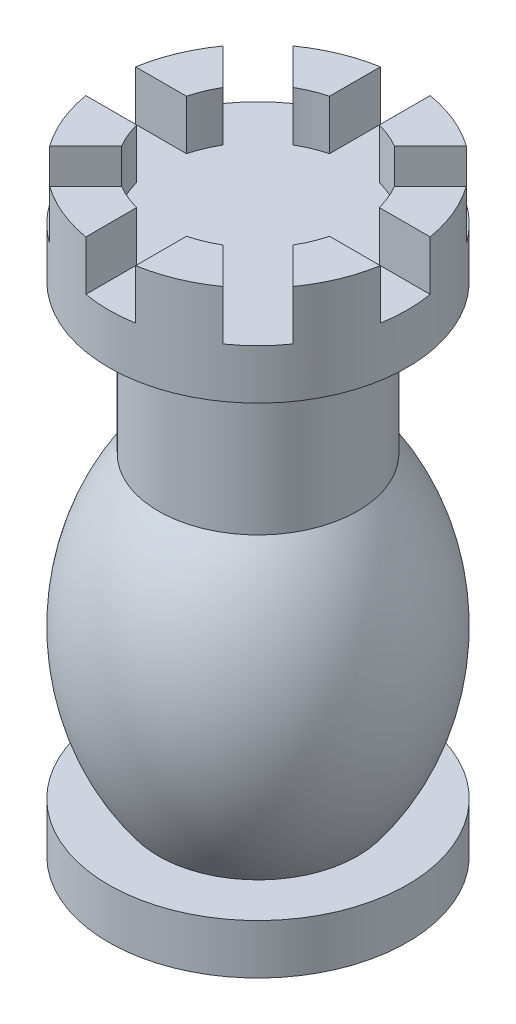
ISO-10303-21;
HEADER;
FILE_DESCRIPTION(('STEP AP214'),'2;1');
FILE_NAME('part.step','',(''),(''),'','','');
FILE_SCHEMA(('AUTOMOTIVE_DESIGN { 1 0 10303 214 1 1 1 1 }'));
ENDSEC;
DATA;
#1=APPLICATION_CONTEXT('core data for automotive mechanical design processes');
#2=APPLICATION_PROTOCOL_DEFINITION('international standard','automotive_design',2000,#1);
#3=PRODUCT_CONTEXT('',#1,'mechanical');
#4=PRODUCT('Part','Part','',(#3));
#5=PRODUCT_RELATED_PRODUCT_CATEGORY('part','',(#4));
#6=PRODUCT_DEFINITION_FORMATION('','',#4);
#7=PRODUCT_DEFINITION_CONTEXT('part definition',#1,'design');
#8=PRODUCT_DEFINITION('design','',#6,#7);
#9=PRODUCT_DEFINITION_SHAPE('','',#8);
#10=(LENGTH_UNIT() NAMED_UNIT(*) SI_UNIT(.MILLI.,.METRE.));
#11=(NAMED_UNIT(*) PLANE_ANGLE_UNIT() SI_UNIT($,.RADIAN.));
#12=(NAMED_UNIT(*) SI_UNIT($,.STERADIAN.) SOLID_ANGLE_UNIT());
#13=UNCERTAINTY_MEASURE_WITH_UNIT(LENGTH_MEASURE(1.E-05),#10,'distance_accuracy_value','');
#14=(GEOMETRIC_REPRESENTATION_CONTEXT(3) GLOBAL_UNCERTAINTY_ASSIGNED_CONTEXT((#13)) GLOBAL_UNIT_ASSIGNED_CONTEXT((#10,
#11,#12)) REPRESENTATION_CONTEXT('',''));
#15=CARTESIAN_POINT('',(0.,0.,0.));
#16=DIRECTION('',(0.,0.,1.));
#17=DIRECTION('',(1.,0.,0.));
#18=AXIS2_PLACEMENT_3D('',#15,#16,#17);
#19=CARTESIAN_POINT('',(0.,34.3216430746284,0.));
#20=DIRECTION('',(0.,1.,0.));
#21=DIRECTION('',(-1.,0.,0.));
#22=AXIS2_PLACEMENT_3D('',#19,#20,#21);
#23=CYLINDRICAL_SURFACE('',#22,4.);
#24=DIRECTION('',(0.,1.,0.));
#25=VECTOR('',#24,1.);
#26=CARTESIAN_POINT('',(-3.44571956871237,34.3216430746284,2.03150600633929));
#27=LINE('',#26,#25);
#28=CARTESIAN_POINT('',(-3.44571956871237,22.,2.03150600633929));
#29=VERTEX_POINT('',#28);
#30=CARTESIAN_POINT('',(-3.44571956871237,24.,2.03150600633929));
#31=VERTEX_POINT('',#30);
#32=EDGE_CURVE('E457',#29,#31,#27,.T.);
#33=ORIENTED_EDGE('',*,*,#32,.F.);
#34=CARTESIAN_POINT('',(0.,22.,0.));
#35=DIRECTION('',(0.,1.,0.));
#36=DIRECTION('',(-1.,0.,0.));
#37=AXIS2_PLACEMENT_3D('',#34,#35,#36);
#38=CIRCLE('',#37,4.);
#39=CARTESIAN_POINT('',(-3.87298334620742,22.,1.));
#40=VERTEX_POINT('',#39);
#41=EDGE_CURVE('E544',#40,#29,#38,.T.);
#42=ORIENTED_EDGE('',*,*,#41,.F.);
#43=DIRECTION('',(0.,1.,0.));
#44=VECTOR('',#43,1.);
#45=CARTESIAN_POINT('',(-3.87298334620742,34.3216430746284,1.));
#46=LINE('',#45,#44);
#47=CARTESIAN_POINT('',(-3.87298334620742,24.,1.));
#48=VERTEX_POINT('',#47);
#49=EDGE_CURVE('E466',#48,#40,#46,.F.);
#50=ORIENTED_EDGE('',*,*,#49,.F.);
#51=CARTESIAN_POINT('',(0.,24.,0.));
#52=DIRECTION('',(0.,1.,0.));
#53=DIRECTION('',(-1.,0.,0.));
#54=AXIS2_PLACEMENT_3D('',#51,#52,#53);
#55=CIRCLE('',#54,4.);
#56=EDGE_CURVE('E286',#48,#31,#55,.T.);
#57=ORIENTED_EDGE('',*,*,#56,.T.);
#58=EDGE_LOOP('',(#33,#42,#50,#57));
#59=FACE_BOUND('',#58,.T.);
#60=ADVANCED_FACE('F33',(#59),#23,.F.);
#61=DIRECTION('',(0.,1.,0.));
#62=VECTOR('',#61,1.);
#63=CARTESIAN_POINT('',(-2.03150600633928,34.3216430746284,3.44571956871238));
#64=LINE('',#63,#62);
#65=CARTESIAN_POINT('',(-2.03150600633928,24.,3.44571956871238));
#66=VERTEX_POINT('',#65);
#67=CARTESIAN_POINT('',(-2.03150600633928,22.,3.44571956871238));
#68=VERTEX_POINT('',#67);
#69=EDGE_CURVE('E455',#66,#68,#64,.F.);
#70=ORIENTED_EDGE('',*,*,#69,.F.);
#71=CARTESIAN_POINT('',(-0.999999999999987,24.,3.87298334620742));
#72=VERTEX_POINT('',#71);
#73=EDGE_CURVE('E547',#66,#72,#55,.T.);
#74=ORIENTED_EDGE('',*,*,#73,.T.);
#75=DIRECTION('',(0.,1.,0.));
#76=VECTOR('',#75,1.);
#77=CARTESIAN_POINT('',(-0.999999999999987,34.3216430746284,3.87298334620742));
#78=LINE('',#77,#76);
#79=CARTESIAN_POINT('',(-0.999999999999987,22.,3.87298334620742));
#80=VERTEX_POINT('',#79);
#81=EDGE_CURVE('E453',#80,#72,#78,.T.);
#82=ORIENTED_EDGE('',*,*,#81,.F.);
#83=EDGE_CURVE('E550',#68,#80,#38,.T.);
#84=ORIENTED_EDGE('',*,*,#83,.F.);
#85=EDGE_LOOP('',(#70,#74,#82,#84));
#86=FACE_BOUND('',#85,.T.);
#87=ADVANCED_FACE('F505',(#86),#23,.F.);
#88=DIRECTION('',(0.,1.,0.));
#89=VECTOR('',#88,1.);
#90=CARTESIAN_POINT('',(1.00000000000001,34.3216430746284,3.87298334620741));
#91=LINE('',#90,#89);
#92=CARTESIAN_POINT('',(1.00000000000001,24.,3.87298334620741));
#93=VERTEX_POINT('',#92);
#94=CARTESIAN_POINT('',(1.00000000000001,22.,3.87298334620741));
#95=VERTEX_POINT('',#94);
#96=EDGE_CURVE('E451',#93,#95,#91,.F.);
#97=ORIENTED_EDGE('',*,*,#96,.F.);
#98=CARTESIAN_POINT('',(2.0315060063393,24.,3.44571956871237));
#99=VERTEX_POINT('',#98);
#100=EDGE_CURVE('E912',#93,#99,#55,.T.);
#101=ORIENTED_EDGE('',*,*,#100,.T.);
#102=DIRECTION('',(0.,1.,0.));
#103=VECTOR('',#102,1.);
#104=CARTESIAN_POINT('',(2.0315060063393,34.3216430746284,3.44571956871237));
#105=LINE('',#104,#103);
#106=CARTESIAN_POINT('',(2.0315060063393,22.,3.44571956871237));
#107=VERTEX_POINT('',#106);
#108=EDGE_CURVE('E449',#107,#99,#105,.T.);
#109=ORIENTED_EDGE('',*,*,#108,.F.);
#110=EDGE_CURVE('E554',#95,#107,#38,.T.);
#111=ORIENTED_EDGE('',*,*,#110,.F.);
#112=EDGE_LOOP('',(#97,#101,#109,#111));
#113=FACE_BOUND('',#112,.T.);
#114=ADVANCED_FACE('F511',(#113),#23,.F.);
#115=DIRECTION('',(0.,1.,0.));
#116=VECTOR('',#115,1.);
#117=CARTESIAN_POINT('',(3.44571956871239,34.3216430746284,2.03150600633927));
#118=LINE('',#117,#116);
#119=CARTESIAN_POINT('',(3.44571956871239,24.,2.03150600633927));
#120=VERTEX_POINT('',#119);
#121=CARTESIAN_POINT('',(3.44571956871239,22.,2.03150600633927));
#122=VERTEX_POINT('',#121);
#123=EDGE_CURVE('E447',#120,#122,#118,.F.);
#124=ORIENTED_EDGE('',*,*,#123,.F.);
#125=CARTESIAN_POINT('',(3.87298334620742,24.,1.));
#126=VERTEX_POINT('',#125);
#127=EDGE_CURVE('E913',#120,#126,#55,.T.);
#128=ORIENTED_EDGE('',*,*,#127,.T.);
#129=DIRECTION('',(0.,1.,0.));
#130=VECTOR('',#129,1.);
#131=CARTESIAN_POINT('',(3.87298334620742,34.3216430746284,1.));
#132=LINE('',#131,#130);
#133=CARTESIAN_POINT('',(3.87298334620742,22.,1.));
#134=VERTEX_POINT('',#133);
#135=EDGE_CURVE('E445',#134,#126,#132,.T.);
#136=ORIENTED_EDGE('',*,*,#135,.F.);
#137=EDGE_CURVE('E557',#122,#134,#38,.T.);
#138=ORIENTED_EDGE('',*,*,#137,.F.);
#139=EDGE_LOOP('',(#124,#128,#136,#138));
#140=FACE_BOUND('',#139,.T.);
#141=ADVANCED_FACE('F775',(#140),#23,.F.);
#142=DIRECTION('',(0.,1.,0.));
#143=VECTOR('',#142,1.);
#144=CARTESIAN_POINT('',(3.87298334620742,34.3216430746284,-1.));
#145=LINE('',#144,#143);
#146=CARTESIAN_POINT('',(3.87298334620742,24.,-1.));
#147=VERTEX_POINT('',#146);
#148=CARTESIAN_POINT('',(3.87298334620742,22.,-1.));
#149=VERTEX_POINT('',#148);
#150=EDGE_CURVE('E443',#147,#149,#145,.F.);
#151=ORIENTED_EDGE('',*,*,#150,.F.);
#152=CARTESIAN_POINT('',(3.44571956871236,24.,-2.03150600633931));
#153=VERTEX_POINT('',#152);
#154=EDGE_CURVE('E896',#147,#153,#55,.T.);
#155=ORIENTED_EDGE('',*,*,#154,.T.);
#156=DIRECTION('',(0.,1.,0.));
#157=VECTOR('',#156,1.);
#158=CARTESIAN_POINT('',(3.44571956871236,34.3216430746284,-2.03150600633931));
#159=LINE('',#158,#157);
#160=CARTESIAN_POINT('',(3.44571956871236,22.,-2.03150600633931));
#161=VERTEX_POINT('',#160);
#162=EDGE_CURVE('E441',#161,#153,#159,.T.);
#163=ORIENTED_EDGE('',*,*,#162,.F.);
#164=EDGE_CURVE('E560',#149,#161,#38,.T.);
#165=ORIENTED_EDGE('',*,*,#164,.F.);
#166=EDGE_LOOP('',(#151,#155,#163,#165));
#167=FACE_BOUND('',#166,.T.);
#168=ADVANCED_FACE('F531',(#167),#23,.F.);
#169=DIRECTION('',(0.,1.,0.));
#170=VECTOR('',#169,1.);
#171=CARTESIAN_POINT('',(2.03150600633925,34.3216430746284,-3.4457195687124));
#172=LINE('',#171,#170);
#173=CARTESIAN_POINT('',(2.03150600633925,24.,-3.4457195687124));
#174=VERTEX_POINT('',#173);
#175=CARTESIAN_POINT('',(2.03150600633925,22.,-3.4457195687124));
#176=VERTEX_POINT('',#175);
#177=EDGE_CURVE('E439',#174,#176,#172,.F.);
#178=ORIENTED_EDGE('',*,*,#177,.F.);
#179=CARTESIAN_POINT('',(0.999999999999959,24.,-3.87298334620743));
#180=VERTEX_POINT('',#179);
#181=EDGE_CURVE('E569',#174,#180,#55,.T.);
#182=ORIENTED_EDGE('',*,*,#181,.T.);
#183=DIRECTION('',(0.,1.,0.));
#184=VECTOR('',#183,1.);
#185=CARTESIAN_POINT('',(0.999999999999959,34.3216430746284,-3.87298334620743));
#186=LINE('',#185,#184);
#187=CARTESIAN_POINT('',(0.999999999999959,22.,-3.87298334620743));
#188=VERTEX_POINT('',#187);
#189=EDGE_CURVE('E437',#188,#180,#186,.T.);
#190=ORIENTED_EDGE('',*,*,#189,.F.);
#191=EDGE_CURVE('E545',#176,#188,#38,.T.);
#192=ORIENTED_EDGE('',*,*,#191,.F.);
#193=EDGE_LOOP('',(#178,#182,#190,#192));
#194=FACE_BOUND('',#193,.T.);
#195=ADVANCED_FACE('F524',(#194),#23,.F.);
#196=DIRECTION('',(0.,1.,0.));
#197=VECTOR('',#196,1.);
#198=CARTESIAN_POINT('',(-1.00000000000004,34.3216430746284,-3.87298334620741));
#199=LINE('',#198,#197);
#200=CARTESIAN_POINT('',(-1.00000000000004,24.,-3.87298334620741));
#201=VERTEX_POINT('',#200);
#202=CARTESIAN_POINT('',(-1.00000000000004,22.,-3.87298334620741));
#203=VERTEX_POINT('',#202);
#204=EDGE_CURVE('E435',#201,#203,#199,.F.);
#205=ORIENTED_EDGE('',*,*,#204,.F.);
#206=CARTESIAN_POINT('',(-2.03150600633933,24.,-3.44571956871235));
#207=VERTEX_POINT('',#206);
#208=EDGE_CURVE('E285',#201,#207,#55,.T.);
#209=ORIENTED_EDGE('',*,*,#208,.T.);
#210=DIRECTION('',(0.,1.,0.));
#211=VECTOR('',#210,1.);
#212=CARTESIAN_POINT('',(-2.03150600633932,34.3216430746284,-3.44571956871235));
#213=LINE('',#212,#211);
#214=CARTESIAN_POINT('',(-2.03150600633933,22.,-3.44571956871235));
#215=VERTEX_POINT('',#214);
#216=EDGE_CURVE('E433',#215,#207,#213,.T.);
#217=ORIENTED_EDGE('',*,*,#216,.F.);
#218=EDGE_CURVE('E536',#203,#215,#38,.T.);
#219=ORIENTED_EDGE('',*,*,#218,.F.);
#220=EDGE_LOOP('',(#205,#209,#217,#219));
#221=FACE_BOUND('',#220,.T.);
#222=ADVANCED_FACE('F517',(#221),#23,.F.);
#223=CARTESIAN_POINT('',(-4.,24.,0.));
#224=DIRECTION('',(0.,1.,0.));
#225=DIRECTION('',(-1.,0.,0.));
#226=AXIS2_PLACEMENT_3D('',#223,#224,#225);
#227=PLANE('',#226);
#228=DIRECTION('',(-0.707106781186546,0.,0.707106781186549));
#229=VECTOR('',#228,1.);
#230=CARTESIAN_POINT('',(-5.6737446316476,24.,4.25953106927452));
#231=LINE('',#230,#229);
#232=CARTESIAN_POINT('',(-4.89040691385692,24.,3.47619335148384));
#233=VERTEX_POINT('',#232);
#234=EDGE_CURVE('E427',#31,#233,#231,.T.);
#235=ORIENTED_EDGE('',*,*,#234,.F.);
#236=ORIENTED_EDGE('',*,*,#56,.F.);
#237=DIRECTION('',(1.,0.,0.));
#238=VECTOR('',#237,1.);
#239=CARTESIAN_POINT('',(-7.02388660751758,24.,1.));
#240=LINE('',#239,#238);
#241=CARTESIAN_POINT('',(-5.91607978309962,24.,1.));
#242=VERTEX_POINT('',#241);
#243=EDGE_CURVE('E459',#242,#48,#240,.T.);
#244=ORIENTED_EDGE('',*,*,#243,.F.);
#245=CARTESIAN_POINT('',(0.,24.,0.));
#246=DIRECTION('',(0.,1.,0.));
#247=DIRECTION('',(-1.,0.,0.));
#248=AXIS2_PLACEMENT_3D('',#245,#246,#247);
#249=CIRCLE('',#248,6.);
#250=EDGE_CURVE('E272',#242,#233,#249,.T.);
#251=ORIENTED_EDGE('',*,*,#250,.T.);
#252=EDGE_LOOP('',(#235,#236,#244,#251));
#253=FACE_BOUND('',#252,.T.);
#254=ADVANCED_FACE('F522',(#253),#227,.T.);
#255=DIRECTION('',(0.707106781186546,0.,-0.707106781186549));
#256=VECTOR('',#255,1.);
#257=CARTESIAN_POINT('',(-4.2595310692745,24.,5.67374463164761));
#258=LINE('',#257,#256);
#259=CARTESIAN_POINT('',(-3.47619335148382,24.,4.89040691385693));
#260=VERTEX_POINT('',#259);
#261=EDGE_CURVE('E421',#260,#66,#258,.T.);
#262=ORIENTED_EDGE('',*,*,#261,.F.);
#263=CARTESIAN_POINT('',(-0.999999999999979,24.,5.91607978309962));
#264=VERTEX_POINT('',#263);
#265=EDGE_CURVE('E280',#260,#264,#249,.T.);
#266=ORIENTED_EDGE('',*,*,#265,.T.);
#267=DIRECTION('',(0.,0.,1.));
#268=VECTOR('',#267,1.);
#269=CARTESIAN_POINT('',(-0.999999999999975,24.,7.02388660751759));
#270=LINE('',#269,#268);
#271=EDGE_CURVE('E418',#72,#264,#270,.T.);
#272=ORIENTED_EDGE('',*,*,#271,.F.);
#273=ORIENTED_EDGE('',*,*,#73,.F.);
#274=EDGE_LOOP('',(#262,#266,#272,#273));
#275=FACE_BOUND('',#274,.T.);
#276=ADVANCED_FACE('F530',(#275),#227,.T.);
#277=DIRECTION('',(0.,0.,-1.));
#278=VECTOR('',#277,1.);
#279=CARTESIAN_POINT('',(1.00000000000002,24.,7.02388660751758));
#280=LINE('',#279,#278);
#281=CARTESIAN_POINT('',(1.00000000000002,24.,5.91607978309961));
#282=VERTEX_POINT('',#281);
#283=EDGE_CURVE('E413',#282,#93,#280,.T.);
#284=ORIENTED_EDGE('',*,*,#283,.F.);
#285=CARTESIAN_POINT('',(3.47619335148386,24.,4.89040691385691));
#286=VERTEX_POINT('',#285);
#287=EDGE_CURVE('E288',#282,#286,#249,.T.);
#288=ORIENTED_EDGE('',*,*,#287,.T.);
#289=DIRECTION('',(0.707106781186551,0.,0.707106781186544));
#290=VECTOR('',#289,1.);
#291=CARTESIAN_POINT('',(4.25953106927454,24.,5.67374463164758));
#292=LINE('',#291,#290);
#293=EDGE_CURVE('E410',#99,#286,#292,.T.);
#294=ORIENTED_EDGE('',*,*,#293,.F.);
#295=ORIENTED_EDGE('',*,*,#100,.F.);
#296=EDGE_LOOP('',(#284,#288,#294,#295));
#297=FACE_BOUND('',#296,.T.);
#298=ADVANCED_FACE('F811',(#297),#227,.T.);
#299=DIRECTION('',(-0.707106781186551,0.,-0.707106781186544));
#300=VECTOR('',#299,1.);
#301=CARTESIAN_POINT('',(5.67374463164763,24.,4.25953106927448));
#302=LINE('',#301,#300);
#303=CARTESIAN_POINT('',(4.89040691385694,24.,3.4761933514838));
#304=VERTEX_POINT('',#303);
#305=EDGE_CURVE('E403',#304,#120,#302,.T.);
#306=ORIENTED_EDGE('',*,*,#305,.F.);
#307=CARTESIAN_POINT('',(5.91607978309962,24.,1.));
#308=VERTEX_POINT('',#307);
#309=EDGE_CURVE('E294',#304,#308,#249,.T.);
#310=ORIENTED_EDGE('',*,*,#309,.T.);
#311=DIRECTION('',(1.,0.,0.));
#312=VECTOR('',#311,1.);
#313=CARTESIAN_POINT('',(7.02388660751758,24.,1.));
#314=LINE('',#313,#312);
#315=EDGE_CURVE('E400',#126,#308,#314,.T.);
#316=ORIENTED_EDGE('',*,*,#315,.F.);
#317=ORIENTED_EDGE('',*,*,#127,.F.);
#318=EDGE_LOOP('',(#306,#310,#316,#317));
#319=FACE_BOUND('',#318,.T.);
#320=ADVANCED_FACE('F818',(#319),#227,.T.);
#321=DIRECTION('',(-1.,0.,0.));
#322=VECTOR('',#321,1.);
#323=CARTESIAN_POINT('',(7.02388660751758,24.,-1.));
#324=LINE('',#323,#322);
#325=CARTESIAN_POINT('',(5.91607978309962,24.,-1.));
#326=VERTEX_POINT('',#325);
#327=EDGE_CURVE('E393',#326,#147,#324,.T.);
#328=ORIENTED_EDGE('',*,*,#327,.F.);
#329=CARTESIAN_POINT('',(4.8904069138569,24.,-3.47619335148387));
#330=VERTEX_POINT('',#329);
#331=EDGE_CURVE('E300',#326,#330,#249,.T.);
#332=ORIENTED_EDGE('',*,*,#331,.T.);
#333=DIRECTION('',(0.707106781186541,0.,-0.707106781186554));
#334=VECTOR('',#333,1.);
#335=CARTESIAN_POINT('',(5.67374463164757,24.,-4.25953106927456));
#336=LINE('',#335,#334);
#337=EDGE_CURVE('E390',#153,#330,#336,.T.);
#338=ORIENTED_EDGE('',*,*,#337,.F.);
#339=ORIENTED_EDGE('',*,*,#154,.F.);
#340=EDGE_LOOP('',(#328,#332,#338,#339));
#341=FACE_BOUND('',#340,.T.);
#342=ADVANCED_FACE('F825',(#341),#227,.T.);
#343=DIRECTION('',(-0.707106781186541,0.,0.707106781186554));
#344=VECTOR('',#343,1.);
#345=CARTESIAN_POINT('',(4.25953106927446,24.,-5.67374463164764));
#346=LINE('',#345,#344);
#347=CARTESIAN_POINT('',(3.47619335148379,24.,-4.89040691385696));
#348=VERTEX_POINT('',#347);
#349=EDGE_CURVE('E319',#348,#174,#346,.T.);
#350=ORIENTED_EDGE('',*,*,#349,.F.);
#351=CARTESIAN_POINT('',(0.999999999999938,24.,-5.91607978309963));
#352=VERTEX_POINT('',#351);
#353=EDGE_CURVE('E274',#348,#352,#249,.T.);
#354=ORIENTED_EDGE('',*,*,#353,.T.);
#355=DIRECTION('',(0.,0.,-1.));
#356=VECTOR('',#355,1.);
#357=CARTESIAN_POINT('',(0.999999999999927,24.,-7.02388660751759));
#358=LINE('',#357,#356);
#359=EDGE_CURVE('E317',#180,#352,#358,.T.);
#360=ORIENTED_EDGE('',*,*,#359,.F.);
#361=ORIENTED_EDGE('',*,*,#181,.F.);
#362=EDGE_LOOP('',(#350,#354,#360,#361));
#363=FACE_BOUND('',#362,.T.);
#364=ADVANCED_FACE('F315',(#363),#227,.T.);
#365=DIRECTION('',(0.,0.,1.));
#366=VECTOR('',#365,1.);
#367=CARTESIAN_POINT('',(-1.00000000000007,24.,-7.02388660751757));
#368=LINE('',#367,#366);
#369=CARTESIAN_POINT('',(-1.00000000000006,24.,-5.91607978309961));
#370=VERTEX_POINT('',#369);
#371=EDGE_CURVE('E368',#370,#201,#368,.T.);
#372=ORIENTED_EDGE('',*,*,#371,.F.);
#373=CARTESIAN_POINT('',(-3.47619335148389,24.,-4.89040691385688));
#374=VERTEX_POINT('',#373);
#375=EDGE_CURVE('E269',#370,#374,#249,.T.);
#376=ORIENTED_EDGE('',*,*,#375,.T.);
#377=DIRECTION('',(-0.707106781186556,0.,-0.707106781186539));
#378=VECTOR('',#377,1.);
#379=CARTESIAN_POINT('',(-4.25953106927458,24.,-5.67374463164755));
#380=LINE('',#379,#378);
#381=EDGE_CURVE('E261',#207,#374,#380,.T.);
#382=ORIENTED_EDGE('',*,*,#381,.F.);
#383=ORIENTED_EDGE('',*,*,#208,.F.);
#384=EDGE_LOOP('',(#372,#376,#382,#383));
#385=FACE_BOUND('',#384,.T.);
#386=ADVANCED_FACE('F375',(#385),#227,.T.);
#387=CARTESIAN_POINT('',(0.,22.,0.));
#388=DIRECTION('',(0.,1.,0.));
#389=DIRECTION('',(-1.,0.,0.));
#390=AXIS2_PLACEMENT_3D('',#387,#388,#389);
#391=PLANE('',#390);
#392=ORIENTED_EDGE('',*,*,#41,.T.);
#393=DIRECTION('',(-0.707106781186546,0.,0.707106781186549));
#394=VECTOR('',#393,1.);
#395=CARTESIAN_POINT('',(-5.6737446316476,22.,4.25953106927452));
#396=LINE('',#395,#394);
#397=CARTESIAN_POINT('',(-4.89040691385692,22.,3.47619335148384));
#398=VERTEX_POINT('',#397);
#399=EDGE_CURVE('E48',#29,#398,#396,.T.);
#400=ORIENTED_EDGE('',*,*,#399,.T.);
#401=CARTESIAN_POINT('',(0.,22.,0.));
#402=DIRECTION('',(0.,1.,0.));
#403=DIRECTION('',(0.,0.,1.));
#404=AXIS2_PLACEMENT_3D('',#401,#402,#403);
#405=CIRCLE('',#404,6.);
#406=CARTESIAN_POINT('',(-3.47619335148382,22.,4.89040691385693));
#407=VERTEX_POINT('',#406);
#408=EDGE_CURVE('E355',#407,#398,#405,.F.);
#409=ORIENTED_EDGE('',*,*,#408,.F.);
#410=DIRECTION('',(0.707106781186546,0.,-0.707106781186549));
#411=VECTOR('',#410,1.);
#412=CARTESIAN_POINT('',(-4.2595310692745,22.,5.67374463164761));
#413=LINE('',#412,#411);
#414=EDGE_CURVE('E424',#407,#68,#413,.T.);
#415=ORIENTED_EDGE('',*,*,#414,.T.);
#416=ORIENTED_EDGE('',*,*,#83,.T.);
#417=DIRECTION('',(0.,0.,1.));
#418=VECTOR('',#417,1.);
#419=CARTESIAN_POINT('',(-0.999999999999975,22.,7.02388660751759));
#420=LINE('',#419,#418);
#421=CARTESIAN_POINT('',(-0.999999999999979,22.,5.91607978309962));
#422=VERTEX_POINT('',#421);
#423=EDGE_CURVE('E417',#80,#422,#420,.T.);
#424=ORIENTED_EDGE('',*,*,#423,.T.);
#425=CARTESIAN_POINT('',(1.00000000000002,22.,5.91607978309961));
#426=VERTEX_POINT('',#425);
#427=EDGE_CURVE('E353',#426,#422,#405,.F.);
#428=ORIENTED_EDGE('',*,*,#427,.F.);
#429=DIRECTION('',(0.,0.,-1.));
#430=VECTOR('',#429,1.);
#431=CARTESIAN_POINT('',(1.00000000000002,22.,7.02388660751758));
#432=LINE('',#431,#430);
#433=EDGE_CURVE('E55',#426,#95,#432,.T.);
#434=ORIENTED_EDGE('',*,*,#433,.T.);
#435=ORIENTED_EDGE('',*,*,#110,.T.);
#436=DIRECTION('',(0.707106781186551,0.,0.707106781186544));
#437=VECTOR('',#436,1.);
#438=CARTESIAN_POINT('',(4.25953106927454,22.,5.67374463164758));
#439=LINE('',#438,#437);
#440=CARTESIAN_POINT('',(3.47619335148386,22.,4.89040691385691));
#441=VERTEX_POINT('',#440);
#442=EDGE_CURVE('E409',#107,#441,#439,.T.);
#443=ORIENTED_EDGE('',*,*,#442,.T.);
#444=CARTESIAN_POINT('',(4.89040691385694,22.,3.47619335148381));
#445=VERTEX_POINT('',#444);
#446=EDGE_CURVE('E348',#445,#441,#405,.F.);
#447=ORIENTED_EDGE('',*,*,#446,.F.);
#448=DIRECTION('',(-0.707106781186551,0.,-0.707106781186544));
#449=VECTOR('',#448,1.);
#450=CARTESIAN_POINT('',(5.67374463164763,22.,4.25953106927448));
#451=LINE('',#450,#449);
#452=EDGE_CURVE('E406',#445,#122,#451,.T.);
#453=ORIENTED_EDGE('',*,*,#452,.T.);
#454=ORIENTED_EDGE('',*,*,#137,.T.);
#455=DIRECTION('',(1.,0.,0.));
#456=VECTOR('',#455,1.);
#457=CARTESIAN_POINT('',(7.02388660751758,22.,1.));
#458=LINE('',#457,#456);
#459=CARTESIAN_POINT('',(5.91607978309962,22.,1.));
#460=VERTEX_POINT('',#459);
#461=EDGE_CURVE('E399',#134,#460,#458,.T.);
#462=ORIENTED_EDGE('',*,*,#461,.T.);
#463=CARTESIAN_POINT('',(5.91607978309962,22.,-1.));
#464=VERTEX_POINT('',#463);
#465=EDGE_CURVE('E343',#464,#460,#405,.F.);
#466=ORIENTED_EDGE('',*,*,#465,.F.);
#467=DIRECTION('',(-1.,0.,0.));
#468=VECTOR('',#467,1.);
#469=CARTESIAN_POINT('',(7.02388660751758,22.,-1.));
#470=LINE('',#469,#468);
#471=EDGE_CURVE('E396',#464,#149,#470,.T.);
#472=ORIENTED_EDGE('',*,*,#471,.T.);
#473=ORIENTED_EDGE('',*,*,#164,.T.);
#474=DIRECTION('',(0.707106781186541,0.,-0.707106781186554));
#475=VECTOR('',#474,1.);
#476=CARTESIAN_POINT('',(5.67374463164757,22.,-4.25953106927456));
#477=LINE('',#476,#475);
#478=CARTESIAN_POINT('',(4.8904069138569,22.,-3.47619335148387));
#479=VERTEX_POINT('',#478);
#480=EDGE_CURVE('E389',#161,#479,#477,.T.);
#481=ORIENTED_EDGE('',*,*,#480,.T.);
#482=CARTESIAN_POINT('',(3.47619335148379,22.,-4.89040691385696));
#483=VERTEX_POINT('',#482);
#484=EDGE_CURVE('E332',#483,#479,#405,.F.);
#485=ORIENTED_EDGE('',*,*,#484,.F.);
#486=DIRECTION('',(-0.707106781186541,0.,0.707106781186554));
#487=VECTOR('',#486,1.);
#488=CARTESIAN_POINT('',(4.25953106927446,22.,-5.67374463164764));
#489=LINE('',#488,#487);
#490=EDGE_CURVE('E386',#483,#176,#489,.T.);
#491=ORIENTED_EDGE('',*,*,#490,.T.);
#492=ORIENTED_EDGE('',*,*,#191,.T.);
#493=DIRECTION('',(0.,0.,-1.));
#494=VECTOR('',#493,1.);
#495=CARTESIAN_POINT('',(0.999999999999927,22.,-7.02388660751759));
#496=LINE('',#495,#494);
#497=CARTESIAN_POINT('',(0.999999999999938,22.,-5.91607978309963));
#498=VERTEX_POINT('',#497);
#499=EDGE_CURVE('E383',#188,#498,#496,.T.);
#500=ORIENTED_EDGE('',*,*,#499,.T.);
#501=CARTESIAN_POINT('',(-1.00000000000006,22.,-5.91607978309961));
#502=VERTEX_POINT('',#501);
#503=EDGE_CURVE('E328',#502,#498,#405,.F.);
#504=ORIENTED_EDGE('',*,*,#503,.F.);
#505=DIRECTION('',(0.,0.,1.));
#506=VECTOR('',#505,1.);
#507=CARTESIAN_POINT('',(-1.00000000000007,22.,-7.02388660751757));
#508=LINE('',#507,#506);
#509=EDGE_CURVE('E371',#502,#203,#508,.T.);
#510=ORIENTED_EDGE('',*,*,#509,.T.);
#511=ORIENTED_EDGE('',*,*,#218,.T.);
#512=DIRECTION('',(-0.707106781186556,0.,-0.707106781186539));
#513=VECTOR('',#512,1.);
#514=CARTESIAN_POINT('',(-4.25953106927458,22.,-5.67374463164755));
#515=LINE('',#514,#513);
#516=CARTESIAN_POINT('',(-3.47619335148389,22.,-4.89040691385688));
#517=VERTEX_POINT('',#516);
#518=EDGE_CURVE('E378',#215,#517,#515,.T.);
#519=ORIENTED_EDGE('',*,*,#518,.T.);
#520=CARTESIAN_POINT('',(-4.89040691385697,22.,-3.47619335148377));
#521=VERTEX_POINT('',#520);
#522=EDGE_CURVE('E251',#521,#517,#405,.F.);
#523=ORIENTED_EDGE('',*,*,#522,.F.);
#524=DIRECTION('',(0.707106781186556,0.,0.707106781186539));
#525=VECTOR('',#524,1.);
#526=CARTESIAN_POINT('',(-5.67374463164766,22.,-4.25953106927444));
#527=LINE('',#526,#525);
#528=CARTESIAN_POINT('',(-3.4457195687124,22.,-2.03150600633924));
#529=VERTEX_POINT('',#528);
#530=EDGE_CURVE('E246',#521,#529,#527,.T.);
#531=ORIENTED_EDGE('',*,*,#530,.T.);
#532=CARTESIAN_POINT('',(-3.87298334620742,22.,-1.));
#533=VERTEX_POINT('',#532);
#534=EDGE_CURVE('E540',#529,#533,#38,.T.);
#535=ORIENTED_EDGE('',*,*,#534,.T.);
#536=DIRECTION('',(-1.,0.,0.));
#537=VECTOR('',#536,1.);
#538=CARTESIAN_POINT('',(-7.02388660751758,22.,-1.));
#539=LINE('',#538,#537);
#540=CARTESIAN_POINT('',(-5.91607978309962,22.,-1.));
#541=VERTEX_POINT('',#540);
#542=EDGE_CURVE('E463',#533,#541,#539,.T.);
#543=ORIENTED_EDGE('',*,*,#542,.T.);
#544=CARTESIAN_POINT('',(0.,22.,0.));
#545=DIRECTION('',(0.,1.,0.));
#546=DIRECTION('',(0.,0.,1.));
#547=AXIS2_PLACEMENT_3D('',#544,#545,#546);
#548=CIRCLE('',#547,6.);
#549=CARTESIAN_POINT('',(-5.91607978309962,22.,1.));
#550=VERTEX_POINT('',#549);
#551=EDGE_CURVE('E549',#550,#541,#548,.F.);
#552=ORIENTED_EDGE('',*,*,#551,.F.);
#553=DIRECTION('',(1.,0.,0.));
#554=VECTOR('',#553,1.);
#555=CARTESIAN_POINT('',(-7.02388660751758,22.,1.));
#556=LINE('',#555,#554);
#557=EDGE_CURVE('E460',#550,#40,#556,.T.);
#558=ORIENTED_EDGE('',*,*,#557,.T.);
#559=EDGE_LOOP('',(#392,#400,#409,#415,#416,#424,#428,#434,#435,#443,#447,#453,#454,#462,#466,
#472,#473,#481,#485,#491,#492,#500,#504,#510,#511,#519,#523,#531,#535,#543,#552,#558));
#560=FACE_BOUND('',#559,.T.);
#561=ADVANCED_FACE('F35',(#560),#391,.T.);
#562=DIRECTION('',(0.,1.,0.));
#563=VECTOR('',#562,1.);
#564=CARTESIAN_POINT('',(-3.4457195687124,34.3216430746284,-2.03150600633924));
#565=LINE('',#564,#563);
#566=CARTESIAN_POINT('',(-3.4457195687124,24.,-2.03150600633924));
#567=VERTEX_POINT('',#566);
#568=EDGE_CURVE('E429',#567,#529,#565,.F.);
#569=ORIENTED_EDGE('',*,*,#568,.F.);
#570=CARTESIAN_POINT('',(-3.87298334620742,24.,-1.));
#571=VERTEX_POINT('',#570);
#572=EDGE_CURVE('E260',#567,#571,#55,.T.);
#573=ORIENTED_EDGE('',*,*,#572,.T.);
#574=DIRECTION('',(0.,1.,0.));
#575=VECTOR('',#574,1.);
#576=CARTESIAN_POINT('',(-3.87298334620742,34.3216430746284,-1.));
#577=LINE('',#576,#575);
#578=EDGE_CURVE('E470',#533,#571,#577,.T.);
#579=ORIENTED_EDGE('',*,*,#578,.F.);
#580=ORIENTED_EDGE('',*,*,#534,.F.);
#581=EDGE_LOOP('',(#569,#573,#579,#580));
#582=FACE_BOUND('',#581,.T.);
#583=ADVANCED_FACE('F507',(#582),#23,.F.);
#584=DIRECTION('',(0.707106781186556,0.,0.707106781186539));
#585=VECTOR('',#584,1.);
#586=CARTESIAN_POINT('',(-5.67374463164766,24.,-4.25953106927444));
#587=LINE('',#586,#585);
#588=CARTESIAN_POINT('',(-4.89040691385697,24.,-3.47619335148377));
#589=VERTEX_POINT('',#588);
#590=EDGE_CURVE('E243',#589,#567,#587,.T.);
#591=ORIENTED_EDGE('',*,*,#590,.F.);
#592=CARTESIAN_POINT('',(-5.91607978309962,24.,-1.));
#593=VERTEX_POINT('',#592);
#594=EDGE_CURVE('E258',#589,#593,#249,.T.);
#595=ORIENTED_EDGE('',*,*,#594,.T.);
#596=DIRECTION('',(-1.,0.,0.));
#597=VECTOR('',#596,1.);
#598=CARTESIAN_POINT('',(-7.02388660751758,24.,-1.));
#599=LINE('',#598,#597);
#600=EDGE_CURVE('E464',#571,#593,#599,.T.);
#601=ORIENTED_EDGE('',*,*,#600,.F.);
#602=ORIENTED_EDGE('',*,*,#572,.F.);
#603=EDGE_LOOP('',(#591,#595,#601,#602));
#604=FACE_BOUND('',#603,.T.);
#605=ADVANCED_FACE('F256',(#604),#227,.T.);
#606=CARTESIAN_POINT('',(0.,34.3216430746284,0.));
#607=DIRECTION('',(0.,1.,0.));
#608=DIRECTION('',(-1.,0.,0.));
#609=AXIS2_PLACEMENT_3D('',#606,#607,#608);
#610=CYLINDRICAL_SURFACE('',#609,6.);
#611=DIRECTION('',(0.,1.,0.));
#612=VECTOR('',#611,1.);
#613=CARTESIAN_POINT('',(-4.89040691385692,34.3216430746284,3.47619335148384));
#614=LINE('',#613,#612);
#615=EDGE_CURVE('E11',#233,#398,#614,.F.);
#616=ORIENTED_EDGE('',*,*,#615,.F.);
#617=ORIENTED_EDGE('',*,*,#250,.F.);
#618=DIRECTION('',(0.,1.,0.));
#619=VECTOR('',#618,1.);
#620=CARTESIAN_POINT('',(-5.91607978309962,34.3216430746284,1.));
#621=LINE('',#620,#619);
#622=EDGE_CURVE('E552',#550,#242,#621,.T.);
#623=ORIENTED_EDGE('',*,*,#622,.F.);
#624=ORIENTED_EDGE('',*,*,#551,.T.);
#625=DIRECTION('',(0.,1.,0.));
#626=VECTOR('',#625,1.);
#627=CARTESIAN_POINT('',(-5.91607978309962,34.3216430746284,-1.));
#628=LINE('',#627,#626);
#629=EDGE_CURVE('E252',#593,#541,#628,.F.);
#630=ORIENTED_EDGE('',*,*,#629,.F.);
#631=ORIENTED_EDGE('',*,*,#594,.F.);
#632=DIRECTION('',(0.,1.,0.));
#633=VECTOR('',#632,1.);
#634=CARTESIAN_POINT('',(-4.89040691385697,34.3216430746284,-3.47619335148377));
#635=LINE('',#634,#633);
#636=EDGE_CURVE('E240',#521,#589,#635,.T.);
#637=ORIENTED_EDGE('',*,*,#636,.F.);
#638=ORIENTED_EDGE('',*,*,#522,.T.);
#639=DIRECTION('',(0.,1.,0.));
#640=VECTOR('',#639,1.);
#641=CARTESIAN_POINT('',(-3.47619335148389,34.3216430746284,-4.89040691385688));
#642=LINE('',#641,#640);
#643=EDGE_CURVE('E361',#374,#517,#642,.F.);
#644=ORIENTED_EDGE('',*,*,#643,.F.);
#645=ORIENTED_EDGE('',*,*,#375,.F.);
#646=DIRECTION('',(0.,1.,0.));
#647=VECTOR('',#646,1.);
#648=CARTESIAN_POINT('',(-1.00000000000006,34.3216430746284,-5.91607978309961));
#649=LINE('',#648,#647);
#650=EDGE_CURVE('E334',#502,#370,#649,.T.);
#651=ORIENTED_EDGE('',*,*,#650,.F.);
#652=ORIENTED_EDGE('',*,*,#503,.T.);
#653=DIRECTION('',(0.,1.,0.));
#654=VECTOR('',#653,1.);
#655=CARTESIAN_POINT('',(0.999999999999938,34.3216430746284,-5.91607978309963));
#656=LINE('',#655,#654);
#657=EDGE_CURVE('E325',#352,#498,#656,.F.);
#658=ORIENTED_EDGE('',*,*,#657,.F.);
#659=ORIENTED_EDGE('',*,*,#353,.F.);
#660=DIRECTION('',(0.,1.,0.));
#661=VECTOR('',#660,1.);
#662=CARTESIAN_POINT('',(3.47619335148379,34.3216430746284,-4.89040691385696));
#663=LINE('',#662,#661);
#664=EDGE_CURVE('E323',#483,#348,#663,.T.);
#665=ORIENTED_EDGE('',*,*,#664,.F.);
#666=ORIENTED_EDGE('',*,*,#484,.T.);
#667=DIRECTION('',(0.,1.,0.));
#668=VECTOR('',#667,1.);
#669=CARTESIAN_POINT('',(4.8904069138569,34.3216430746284,-3.47619335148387));
#670=LINE('',#669,#668);
#671=EDGE_CURVE('E339',#330,#479,#670,.F.);
#672=ORIENTED_EDGE('',*,*,#671,.F.);
#673=ORIENTED_EDGE('',*,*,#331,.F.);
#674=DIRECTION('',(0.,1.,0.));
#675=VECTOR('',#674,1.);
#676=CARTESIAN_POINT('',(5.91607978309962,34.3216430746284,-1.));
#677=LINE('',#676,#675);
#678=EDGE_CURVE('E341',#464,#326,#677,.T.);
#679=ORIENTED_EDGE('',*,*,#678,.F.);
#680=ORIENTED_EDGE('',*,*,#465,.T.);
#681=DIRECTION('',(0.,1.,0.));
#682=VECTOR('',#681,1.);
#683=CARTESIAN_POINT('',(5.91607978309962,34.3216430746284,1.));
#684=LINE('',#683,#682);
#685=EDGE_CURVE('E344',#308,#460,#684,.F.);
#686=ORIENTED_EDGE('',*,*,#685,.F.);
#687=ORIENTED_EDGE('',*,*,#309,.F.);
#688=DIRECTION('',(0.,1.,0.));
#689=VECTOR('',#688,1.);
#690=CARTESIAN_POINT('',(4.89040691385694,34.3216430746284,3.47619335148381));
#691=LINE('',#690,#689);
#692=EDGE_CURVE('E346',#445,#304,#691,.T.);
#693=ORIENTED_EDGE('',*,*,#692,.F.);
#694=ORIENTED_EDGE('',*,*,#446,.T.);
#695=DIRECTION('',(0.,1.,0.));
#696=VECTOR('',#695,1.);
#697=CARTESIAN_POINT('',(3.47619335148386,34.3216430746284,4.89040691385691));
#698=LINE('',#697,#696);
#699=EDGE_CURVE('E349',#286,#441,#698,.F.);
#700=ORIENTED_EDGE('',*,*,#699,.F.);
#701=ORIENTED_EDGE('',*,*,#287,.F.);
#702=DIRECTION('',(0.,1.,0.));
#703=VECTOR('',#702,1.);
#704=CARTESIAN_POINT('',(1.00000000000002,34.3216430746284,5.91607978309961));
#705=LINE('',#704,#703);
#706=EDGE_CURVE('E351',#426,#282,#705,.T.);
#707=ORIENTED_EDGE('',*,*,#706,.F.);
#708=ORIENTED_EDGE('',*,*,#427,.T.);
#709=DIRECTION('',(0.,1.,0.));
#710=VECTOR('',#709,1.);
#711=CARTESIAN_POINT('',(-0.999999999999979,34.3216430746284,5.91607978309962));
#712=LINE('',#711,#710);
#713=EDGE_CURVE('E354',#264,#422,#712,.F.);
#714=ORIENTED_EDGE('',*,*,#713,.F.);
#715=ORIENTED_EDGE('',*,*,#265,.F.);
#716=DIRECTION('',(0.,1.,0.));
#717=VECTOR('',#716,1.);
#718=CARTESIAN_POINT('',(-3.47619335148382,34.3216430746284,4.89040691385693));
#719=LINE('',#718,#717);
#720=EDGE_CURVE('E41',#407,#260,#719,.T.);
#721=ORIENTED_EDGE('',*,*,#720,.F.);
#722=ORIENTED_EDGE('',*,*,#408,.T.);
#723=EDGE_LOOP('',(#616,#617,#623,#624,#630,#631,#637,#638,#644,#645,#651,#652,#658,#659,#665,
#666,#672,#673,#679,#680,#686,#687,#693,#694,#700,#701,#707,#708,#714,#715,#721,#722));
#724=FACE_BOUND('',#723,.T.);
#725=CARTESIAN_POINT('',(0.,20.,0.));
#726=DIRECTION('',(0.,1.,0.));
#727=DIRECTION('',(-1.,0.,0.));
#728=AXIS2_PLACEMENT_3D('',#725,#726,#727);
#729=CIRCLE('',#728,6.);
#730=CARTESIAN_POINT('',(-6.,20.,0.));
#731=VERTEX_POINT('',#730);
#732=EDGE_CURVE('E270',#731,#731,#729,.T.);
#733=ORIENTED_EDGE('',*,*,#732,.T.);
#734=EDGE_LOOP('',(#733));
#735=FACE_BOUND('',#734,.T.);
#736=ADVANCED_FACE('F265',(#724,#735),#610,.T.);
#737=CARTESIAN_POINT('',(-6.,20.,0.));
#738=DIRECTION('',(0.,-1.,0.));
#739=DIRECTION('',(1.,0.,0.));
#740=AXIS2_PLACEMENT_3D('',#737,#738,#739);
#741=PLANE('',#740);
#742=CARTESIAN_POINT('',(0.,20.,0.));
#743=DIRECTION('',(0.,1.,0.));
#744=DIRECTION('',(-1.,0.,0.));
#745=AXIS2_PLACEMENT_3D('',#742,#743,#744);
#746=CIRCLE('',#745,4.);
#747=CARTESIAN_POINT('',(-4.,20.,0.));
#748=VERTEX_POINT('',#747);
#749=EDGE_CURVE('E276',#748,#748,#746,.T.);
#750=ORIENTED_EDGE('',*,*,#749,.T.);
#751=EDGE_LOOP('',(#750));
#752=FACE_BOUND('',#751,.T.);
#753=ORIENTED_EDGE('',*,*,#732,.F.);
#754=EDGE_LOOP('',(#753));
#755=FACE_BOUND('',#754,.T.);
#756=ADVANCED_FACE('F488',(#752,#755),#741,.T.);
#757=CARTESIAN_POINT('',(0.,34.3216430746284,0.));
#758=DIRECTION('',(0.,1.,0.));
#759=DIRECTION('',(-1.,0.,0.));
#760=AXIS2_PLACEMENT_3D('',#757,#758,#759);
#761=CYLINDRICAL_SURFACE('',#760,4.);
#762=CARTESIAN_POINT('',(0.,14.,0.));
#763=DIRECTION('',(0.,1.,0.));
#764=DIRECTION('',(-1.,0.,0.));
#765=AXIS2_PLACEMENT_3D('',#762,#763,#764);
#766=CIRCLE('',#765,4.);
#767=CARTESIAN_POINT('',(-4.,14.,0.));
#768=VERTEX_POINT('',#767);
#769=EDGE_CURVE('E482',#768,#768,#766,.T.);
#770=ORIENTED_EDGE('',*,*,#769,.T.);
#771=EDGE_LOOP('',(#770));
#772=FACE_BOUND('',#771,.T.);
#773=ORIENTED_EDGE('',*,*,#749,.F.);
#774=EDGE_LOOP('',(#773));
#775=FACE_BOUND('',#774,.T.);
#776=ADVANCED_FACE('F491',(#772,#775),#761,.T.);
#777=CARTESIAN_POINT('',(0.,8.,0.));
#778=DIRECTION('',(0.,1.,0.));
#779=DIRECTION('',(-1.,0.,0.));
#780=AXIS2_PLACEMENT_3D('',#777,#778,#779);
#781=DEGENERATE_TOROIDAL_SURFACE('',#780,4.,10.,.F.);
#782=CARTESIAN_POINT('',(0.,2.,0.));
#783=DIRECTION('',(0.,1.,0.));
#784=DIRECTION('',(-1.,0.,0.));
#785=AXIS2_PLACEMENT_3D('',#782,#783,#784);
#786=CIRCLE('',#785,4.);
#787=CARTESIAN_POINT('',(-4.,2.,0.));
#788=VERTEX_POINT('',#787);
#789=EDGE_CURVE('E479',#788,#788,#786,.T.);
#790=ORIENTED_EDGE('',*,*,#789,.T.);
#791=EDGE_LOOP('',(#790));
#792=FACE_BOUND('',#791,.T.);
#793=ORIENTED_EDGE('',*,*,#769,.F.);
#794=EDGE_LOOP('',(#793));
#795=FACE_BOUND('',#794,.T.);
#796=ADVANCED_FACE('F493',(#792,#795),#781,.F.);
#797=CARTESIAN_POINT('',(-6.,2.,0.));
#798=DIRECTION('',(0.,1.,0.));
#799=DIRECTION('',(-1.,0.,0.));
#800=AXIS2_PLACEMENT_3D('',#797,#798,#799);
#801=PLANE('',#800);
#802=CARTESIAN_POINT('',(0.,2.,0.));
#803=DIRECTION('',(0.,1.,0.));
#804=DIRECTION('',(-1.,0.,0.));
#805=AXIS2_PLACEMENT_3D('',#802,#803,#804);
#806=CIRCLE('',#805,6.);
#807=CARTESIAN_POINT('',(-6.,2.,0.));
#808=VERTEX_POINT('',#807);
#809=EDGE_CURVE('E476',#808,#808,#806,.T.);
#810=ORIENTED_EDGE('',*,*,#809,.T.);
#811=EDGE_LOOP('',(#810));
#812=FACE_BOUND('',#811,.T.);
#813=ORIENTED_EDGE('',*,*,#789,.F.);
#814=EDGE_LOOP('',(#813));
#815=FACE_BOUND('',#814,.T.);
#816=ADVANCED_FACE('F500',(#812,#815),#801,.T.);
#817=CARTESIAN_POINT('',(0.,34.3216430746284,0.));
#818=DIRECTION('',(0.,1.,0.));
#819=DIRECTION('',(-1.,0.,0.));
#820=AXIS2_PLACEMENT_3D('',#817,#818,#819);
#821=CYLINDRICAL_SURFACE('',#820,6.);
#822=CARTESIAN_POINT('',(0.,0.,0.));
#823=DIRECTION('',(0.,1.,0.));
#824=DIRECTION('',(-1.,0.,0.));
#825=AXIS2_PLACEMENT_3D('',#822,#823,#824);
#826=CIRCLE('',#825,6.);
#827=CARTESIAN_POINT('',(-6.,0.,0.));
#828=VERTEX_POINT('',#827);
#829=EDGE_CURVE('E473',#828,#828,#826,.T.);
#830=ORIENTED_EDGE('',*,*,#829,.T.);
#831=EDGE_LOOP('',(#830));
#832=FACE_BOUND('',#831,.T.);
#833=ORIENTED_EDGE('',*,*,#809,.F.);
#834=EDGE_LOOP('',(#833));
#835=FACE_BOUND('',#834,.T.);
#836=ADVANCED_FACE('F630',(#832,#835),#821,.T.);
#837=CARTESIAN_POINT('',(0.,0.,0.));
#838=DIRECTION('',(0.,-1.,0.));
#839=DIRECTION('',(1.,0.,0.));
#840=AXIS2_PLACEMENT_3D('',#837,#838,#839);
#841=PLANE('',#840);
#842=ORIENTED_EDGE('',*,*,#829,.F.);
#843=EDGE_LOOP('',(#842));
#844=FACE_BOUND('',#843,.T.);
#845=ADVANCED_FACE('F623',(#844),#841,.T.);
#846=CARTESIAN_POINT('',(-7.02388660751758,22.,-1.));
#847=DIRECTION('',(0.,0.,-1.));
#848=DIRECTION('',(-1.,0.,0.));
#849=AXIS2_PLACEMENT_3D('',#846,#847,#848);
#850=PLANE('',#849);
#851=ORIENTED_EDGE('',*,*,#578,.T.);
#852=ORIENTED_EDGE('',*,*,#600,.T.);
#853=ORIENTED_EDGE('',*,*,#629,.T.);
#854=ORIENTED_EDGE('',*,*,#542,.F.);
#855=EDGE_LOOP('',(#851,#852,#853,#854));
#856=FACE_BOUND('',#855,.T.);
#857=ADVANCED_FACE('F619',(#856),#850,.F.);
#858=CARTESIAN_POINT('',(-7.02388660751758,22.,1.));
#859=DIRECTION('',(0.,0.,1.));
#860=DIRECTION('',(1.,0.,0.));
#861=AXIS2_PLACEMENT_3D('',#858,#859,#860);
#862=PLANE('',#861);
#863=ORIENTED_EDGE('',*,*,#49,.T.);
#864=ORIENTED_EDGE('',*,*,#557,.F.);
#865=ORIENTED_EDGE('',*,*,#622,.T.);
#866=ORIENTED_EDGE('',*,*,#243,.T.);
#867=EDGE_LOOP('',(#863,#864,#865,#866));
#868=FACE_BOUND('',#867,.T.);
#869=ADVANCED_FACE('F622',(#868),#862,.F.);
#870=CARTESIAN_POINT('',(-5.67374463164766,22.,-4.25953106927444));
#871=DIRECTION('',(-0.707106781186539,0.,0.707106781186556));
#872=DIRECTION('',(0.707106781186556,0.,0.707106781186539));
#873=AXIS2_PLACEMENT_3D('',#870,#871,#872);
#874=PLANE('',#873);
#875=ORIENTED_EDGE('',*,*,#568,.T.);
#876=ORIENTED_EDGE('',*,*,#530,.F.);
#877=ORIENTED_EDGE('',*,*,#636,.T.);
#878=ORIENTED_EDGE('',*,*,#590,.T.);
#879=EDGE_LOOP('',(#875,#876,#877,#878));
#880=FACE_BOUND('',#879,.T.);
#881=ADVANCED_FACE('F242',(#880),#874,.F.);
#882=CARTESIAN_POINT('',(-4.25953106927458,22.,-5.67374463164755));
#883=DIRECTION('',(0.707106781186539,0.,-0.707106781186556));
#884=DIRECTION('',(-0.707106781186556,0.,-0.707106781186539));
#885=AXIS2_PLACEMENT_3D('',#882,#883,#884);
#886=PLANE('',#885);
#887=ORIENTED_EDGE('',*,*,#216,.T.);
#888=ORIENTED_EDGE('',*,*,#381,.T.);
#889=ORIENTED_EDGE('',*,*,#643,.T.);
#890=ORIENTED_EDGE('',*,*,#518,.F.);
#891=EDGE_LOOP('',(#887,#888,#889,#890));
#892=FACE_BOUND('',#891,.T.);
#893=ADVANCED_FACE('F581',(#892),#886,.F.);
#894=CARTESIAN_POINT('',(-1.00000000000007,22.,-7.02388660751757));
#895=DIRECTION('',(-1.,0.,0.));
#896=DIRECTION('',(0.,0.,1.));
#897=AXIS2_PLACEMENT_3D('',#894,#895,#896);
#898=PLANE('',#897);
#899=ORIENTED_EDGE('',*,*,#204,.T.);
#900=ORIENTED_EDGE('',*,*,#509,.F.);
#901=ORIENTED_EDGE('',*,*,#650,.T.);
#902=ORIENTED_EDGE('',*,*,#371,.T.);
#903=EDGE_LOOP('',(#899,#900,#901,#902));
#904=FACE_BOUND('',#903,.T.);
#905=ADVANCED_FACE('F367',(#904),#898,.F.);
#906=CARTESIAN_POINT('',(0.999999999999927,22.,-7.02388660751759));
#907=DIRECTION('',(1.,0.,0.));
#908=DIRECTION('',(0.,0.,-1.));
#909=AXIS2_PLACEMENT_3D('',#906,#907,#908);
#910=PLANE('',#909);
#911=ORIENTED_EDGE('',*,*,#189,.T.);
#912=ORIENTED_EDGE('',*,*,#359,.T.);
#913=ORIENTED_EDGE('',*,*,#657,.T.);
#914=ORIENTED_EDGE('',*,*,#499,.F.);
#915=EDGE_LOOP('',(#911,#912,#913,#914));
#916=FACE_BOUND('',#915,.T.);
#917=ADVANCED_FACE('F570',(#916),#910,.F.);
#918=CARTESIAN_POINT('',(4.25953106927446,22.,-5.67374463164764));
#919=DIRECTION('',(-0.707106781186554,0.,-0.707106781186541));
#920=DIRECTION('',(-0.707106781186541,0.,0.707106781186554));
#921=AXIS2_PLACEMENT_3D('',#918,#919,#920);
#922=PLANE('',#921);
#923=ORIENTED_EDGE('',*,*,#177,.T.);
#924=ORIENTED_EDGE('',*,*,#490,.F.);
#925=ORIENTED_EDGE('',*,*,#664,.T.);
#926=ORIENTED_EDGE('',*,*,#349,.T.);
#927=EDGE_LOOP('',(#923,#924,#925,#926));
#928=FACE_BOUND('',#927,.T.);
#929=ADVANCED_FACE('F572',(#928),#922,.F.);
#930=CARTESIAN_POINT('',(5.67374463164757,22.,-4.25953106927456));
#931=DIRECTION('',(0.707106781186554,0.,0.707106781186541));
#932=DIRECTION('',(0.707106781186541,0.,-0.707106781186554));
#933=AXIS2_PLACEMENT_3D('',#930,#931,#932);
#934=PLANE('',#933);
#935=ORIENTED_EDGE('',*,*,#162,.T.);
#936=ORIENTED_EDGE('',*,*,#337,.T.);
#937=ORIENTED_EDGE('',*,*,#671,.T.);
#938=ORIENTED_EDGE('',*,*,#480,.F.);
#939=EDGE_LOOP('',(#935,#936,#937,#938));
#940=FACE_BOUND('',#939,.T.);
#941=ADVANCED_FACE('F578',(#940),#934,.F.);
#942=CARTESIAN_POINT('',(7.02388660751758,22.,-1.));
#943=DIRECTION('',(0.,0.,-1.));
#944=DIRECTION('',(-1.,0.,0.));
#945=AXIS2_PLACEMENT_3D('',#942,#943,#944);
#946=PLANE('',#945);
#947=ORIENTED_EDGE('',*,*,#150,.T.);
#948=ORIENTED_EDGE('',*,*,#471,.F.);
#949=ORIENTED_EDGE('',*,*,#678,.T.);
#950=ORIENTED_EDGE('',*,*,#327,.T.);
#951=EDGE_LOOP('',(#947,#948,#949,#950));
#952=FACE_BOUND('',#951,.T.);
#953=ADVANCED_FACE('F587',(#952),#946,.F.);
#954=CARTESIAN_POINT('',(7.02388660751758,22.,1.));
#955=DIRECTION('',(0.,0.,1.));
#956=DIRECTION('',(1.,0.,0.));
#957=AXIS2_PLACEMENT_3D('',#954,#955,#956);
#958=PLANE('',#957);
#959=ORIENTED_EDGE('',*,*,#135,.T.);
#960=ORIENTED_EDGE('',*,*,#315,.T.);
#961=ORIENTED_EDGE('',*,*,#685,.T.);
#962=ORIENTED_EDGE('',*,*,#461,.F.);
#963=EDGE_LOOP('',(#959,#960,#961,#962));
#964=FACE_BOUND('',#963,.T.);
#965=ADVANCED_FACE('F590',(#964),#958,.F.);
#966=CARTESIAN_POINT('',(5.67374463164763,22.,4.25953106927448));
#967=DIRECTION('',(0.707106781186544,0.,-0.707106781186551));
#968=DIRECTION('',(-0.707106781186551,0.,-0.707106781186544));
#969=AXIS2_PLACEMENT_3D('',#966,#967,#968);
#970=PLANE('',#969);
#971=ORIENTED_EDGE('',*,*,#123,.T.);
#972=ORIENTED_EDGE('',*,*,#452,.F.);
#973=ORIENTED_EDGE('',*,*,#692,.T.);
#974=ORIENTED_EDGE('',*,*,#305,.T.);
#975=EDGE_LOOP('',(#971,#972,#973,#974));
#976=FACE_BOUND('',#975,.T.);
#977=ADVANCED_FACE('F593',(#976),#970,.F.);
#978=CARTESIAN_POINT('',(4.25953106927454,22.,5.67374463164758));
#979=DIRECTION('',(-0.707106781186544,0.,0.707106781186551));
#980=DIRECTION('',(0.707106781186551,0.,0.707106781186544));
#981=AXIS2_PLACEMENT_3D('',#978,#979,#980);
#982=PLANE('',#981);
#983=ORIENTED_EDGE('',*,*,#108,.T.);
#984=ORIENTED_EDGE('',*,*,#293,.T.);
#985=ORIENTED_EDGE('',*,*,#699,.T.);
#986=ORIENTED_EDGE('',*,*,#442,.F.);
#987=EDGE_LOOP('',(#983,#984,#985,#986));
#988=FACE_BOUND('',#987,.T.);
#989=ADVANCED_FACE('F598',(#988),#982,.F.);
#990=CARTESIAN_POINT('',(1.00000000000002,22.,7.02388660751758));
#991=DIRECTION('',(1.,0.,0.));
#992=DIRECTION('',(0.,0.,-1.));
#993=AXIS2_PLACEMENT_3D('',#990,#991,#992);
#994=PLANE('',#993);
#995=ORIENTED_EDGE('',*,*,#96,.T.);
#996=ORIENTED_EDGE('',*,*,#433,.F.);
#997=ORIENTED_EDGE('',*,*,#706,.T.);
#998=ORIENTED_EDGE('',*,*,#283,.T.);
#999=EDGE_LOOP('',(#995,#996,#997,#998));
#1000=FACE_BOUND('',#999,.T.);
#1001=ADVANCED_FACE('F601',(#1000),#994,.F.);
#1002=CARTESIAN_POINT('',(-0.999999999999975,22.,7.02388660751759));
#1003=DIRECTION('',(-1.,0.,0.));
#1004=DIRECTION('',(0.,0.,1.));
#1005=AXIS2_PLACEMENT_3D('',#1002,#1003,#1004);
#1006=PLANE('',#1005);
#1007=ORIENTED_EDGE('',*,*,#81,.T.);
#1008=ORIENTED_EDGE('',*,*,#271,.T.);
#1009=ORIENTED_EDGE('',*,*,#713,.T.);
#1010=ORIENTED_EDGE('',*,*,#423,.F.);
#1011=EDGE_LOOP('',(#1007,#1008,#1009,#1010));
#1012=FACE_BOUND('',#1011,.T.);
#1013=ADVANCED_FACE('F606',(#1012),#1006,.F.);
#1014=CARTESIAN_POINT('',(-5.6737446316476,22.,4.25953106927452));
#1015=DIRECTION('',(-0.707106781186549,0.,-0.707106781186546));
#1016=DIRECTION('',(-0.707106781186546,0.,0.707106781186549));
#1017=AXIS2_PLACEMENT_3D('',#1014,#1015,#1016);
#1018=PLANE('',#1017);
#1019=ORIENTED_EDGE('',*,*,#32,.T.);
#1020=ORIENTED_EDGE('',*,*,#234,.T.);
#1021=ORIENTED_EDGE('',*,*,#615,.T.);
#1022=ORIENTED_EDGE('',*,*,#399,.F.);
#1023=EDGE_LOOP('',(#1019,#1020,#1021,#1022));
#1024=FACE_BOUND('',#1023,.T.);
#1025=ADVANCED_FACE('F609',(#1024),#1018,.F.);
#1026=CARTESIAN_POINT('',(-4.2595310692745,22.,5.67374463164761));
#1027=DIRECTION('',(0.707106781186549,0.,0.707106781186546));
#1028=DIRECTION('',(0.707106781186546,0.,-0.707106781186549));
#1029=AXIS2_PLACEMENT_3D('',#1026,#1027,#1028);
#1030=PLANE('',#1029);
#1031=ORIENTED_EDGE('',*,*,#69,.T.);
#1032=ORIENTED_EDGE('',*,*,#414,.F.);
#1033=ORIENTED_EDGE('',*,*,#720,.T.);
#1034=ORIENTED_EDGE('',*,*,#261,.T.);
#1035=EDGE_LOOP('',(#1031,#1032,#1033,#1034));
#1036=FACE_BOUND('',#1035,.T.);
#1037=ADVANCED_FACE('F615',(#1036),#1030,.F.);
#1038=CLOSED_SHELL('',(#60,#87,#114,#141,#168,#195,#222,#254,#276,#298,#320,#342,#364,#386,#561,
#583,#605,#736,#756,#776,#796,#816,#836,#845,#857,#869,#881,#893,#905,#917,#929,#941,#953,#965,
#977,#989,#1001,#1013,#1025,#1037));
#1039=MANIFOLD_SOLID_BREP('B2',#1038);
#1040=ADVANCED_BREP_SHAPE_REPRESENTATION('',(#18,#1039),#14);
#1041=SHAPE_DEFINITION_REPRESENTATION(#9,#1040);
ENDSEC;
END-ISO-10303-21;
